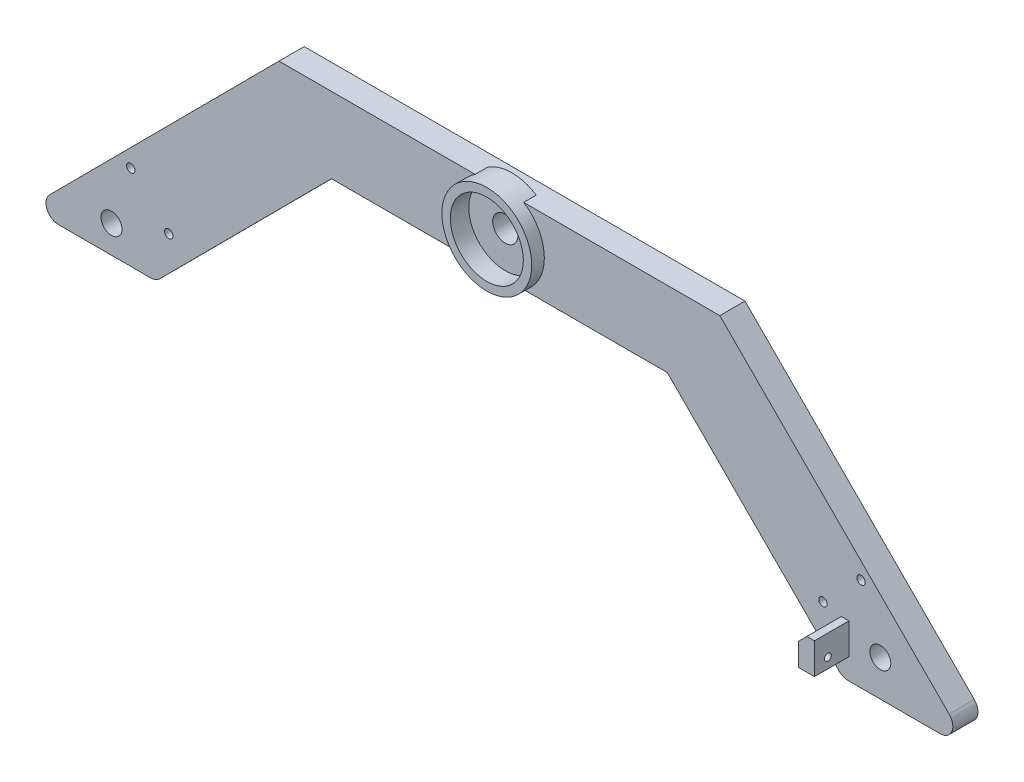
ISO-10303-21;
HEADER;
FILE_DESCRIPTION(('STEP AP214'),'2;1');
FILE_NAME('part.step','',(''),(''),'','','');
FILE_SCHEMA(('AUTOMOTIVE_DESIGN { 1 0 10303 214 1 1 1 1 }'));
ENDSEC;
DATA;
#1=APPLICATION_CONTEXT('core data for automotive mechanical design processes');
#2=APPLICATION_PROTOCOL_DEFINITION('international standard','automotive_design',2000,#1);
#3=PRODUCT_CONTEXT('',#1,'mechanical');
#4=PRODUCT('Part','Part','',(#3));
#5=PRODUCT_RELATED_PRODUCT_CATEGORY('part','',(#4));
#6=PRODUCT_DEFINITION_FORMATION('','',#4);
#7=PRODUCT_DEFINITION_CONTEXT('part definition',#1,'design');
#8=PRODUCT_DEFINITION('design','',#6,#7);
#9=PRODUCT_DEFINITION_SHAPE('','',#8);
#10=(LENGTH_UNIT() NAMED_UNIT(*) SI_UNIT(.MILLI.,.METRE.));
#11=(NAMED_UNIT(*) PLANE_ANGLE_UNIT() SI_UNIT($,.RADIAN.));
#12=(NAMED_UNIT(*) SI_UNIT($,.STERADIAN.) SOLID_ANGLE_UNIT());
#13=UNCERTAINTY_MEASURE_WITH_UNIT(LENGTH_MEASURE(1.E-05),#10,'distance_accuracy_value','');
#14=(GEOMETRIC_REPRESENTATION_CONTEXT(3) GLOBAL_UNCERTAINTY_ASSIGNED_CONTEXT((#13)) GLOBAL_UNIT_ASSIGNED_CONTEXT((#10,
#11,#12)) REPRESENTATION_CONTEXT('',''));
#15=CARTESIAN_POINT('',(0.,0.,0.));
#16=DIRECTION('',(0.,0.,1.));
#17=DIRECTION('',(1.,0.,0.));
#18=AXIS2_PLACEMENT_3D('',#15,#16,#17);
#19=CARTESIAN_POINT('',(-47.8356723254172,-72.890134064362,3.81));
#20=DIRECTION('',(0.,0.,-1.));
#21=DIRECTION('',(-1.,0.,0.));
#22=AXIS2_PLACEMENT_3D('',#19,#20,#21);
#23=PLANE('',#22);
#24=CARTESIAN_POINT('',(155.520779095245,-59.8647554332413,3.81));
#25=DIRECTION('',(0.,0.,-1.));
#26=DIRECTION('',(-1.,0.,0.));
#27=AXIS2_PLACEMENT_3D('',#24,#25,#26);
#28=CIRCLE('',#27,1.27);
#29=CARTESIAN_POINT('',(154.250779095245,-59.8647554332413,3.81));
#30=VERTEX_POINT('',#29);
#31=EDGE_CURVE('E560',#30,#30,#28,.T.);
#32=ORIENTED_EDGE('',*,*,#31,.T.);
#33=EDGE_LOOP('',(#32));
#34=FACE_BOUND('',#33,.T.);
#35=CARTESIAN_POINT('',(167.024128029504,-48.4154819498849,3.81));
#36=DIRECTION('',(0.,0.,-1.));
#37=DIRECTION('',(-1.,0.,0.));
#38=AXIS2_PLACEMENT_3D('',#35,#36,#37);
#39=CIRCLE('',#38,1.27);
#40=CARTESIAN_POINT('',(165.754128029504,-48.4154819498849,3.81));
#41=VERTEX_POINT('',#40);
#42=EDGE_CURVE('E555',#41,#41,#39,.T.);
#43=ORIENTED_EDGE('',*,*,#42,.T.);
#44=EDGE_LOOP('',(#43));
#45=FACE_BOUND('',#44,.T.);
#46=CARTESIAN_POINT('',(172.855760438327,-65.778134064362,3.81));
#47=DIRECTION('',(0.,0.,1.));
#48=DIRECTION('',(1.,0.,0.));
#49=AXIS2_PLACEMENT_3D('',#46,#47,#48);
#50=CIRCLE('',#49,3.175);
#51=CARTESIAN_POINT('',(176.030760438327,-65.778134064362,3.81));
#52=VERTEX_POINT('',#51);
#53=EDGE_CURVE('E276',#52,#52,#50,.T.);
#54=ORIENTED_EDGE('',*,*,#53,.F.);
#55=EDGE_LOOP('',(#54));
#56=FACE_BOUND('',#55,.T.);
#57=CARTESIAN_POINT('',(57.6277046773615,-11.930134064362,3.81));
#58=DIRECTION('',(0.,0.,-1.));
#59=DIRECTION('',(-1.,0.,0.));
#60=AXIS2_PLACEMENT_3D('',#57,#58,#59);
#61=CIRCLE('',#60,13.589);
#62=CARTESIAN_POINT('',(64.9627208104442,-23.3694723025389,3.81));
#63=VERTEX_POINT('',#62);
#64=CARTESIAN_POINT('',(64.9772639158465,-0.500134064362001,3.81));
#65=VERTEX_POINT('',#64);
#66=EDGE_CURVE('E416',#63,#65,#61,.F.);
#67=ORIENTED_EDGE('',*,*,#66,.F.);
#68=DIRECTION('',(1.,0.,0.));
#69=VECTOR('',#68,1.);
#70=CARTESIAN_POINT('',(6.82770467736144,-23.3694723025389,3.81));
#71=LINE('',#70,#69);
#72=CARTESIAN_POINT('',(108.427704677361,-23.3694723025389,3.81));
#73=VERTEX_POINT('',#72);
#74=EDGE_CURVE('E326',#63,#73,#71,.T.);
#75=ORIENTED_EDGE('',*,*,#74,.T.);
#76=DIRECTION('',(-0.7054389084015,0.708770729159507,0.));
#77=VECTOR('',#76,1.);
#78=CARTESIAN_POINT('',(160.390665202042,-75.5778563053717,3.81));
#79=LINE('',#78,#77);
#80=CARTESIAN_POINT('',(160.390665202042,-75.5778563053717,3.81));
#81=VERTEX_POINT('',#80);
#82=EDGE_CURVE('E322',#81,#73,#79,.T.);
#83=ORIENTED_EDGE('',*,*,#82,.F.);
#84=CARTESIAN_POINT('',(163.09108168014,-72.890134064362,3.81));
#85=DIRECTION('',(0.,0.,1.));
#86=DIRECTION('',(1.,0.,0.));
#87=AXIS2_PLACEMENT_3D('',#84,#85,#86);
#88=CIRCLE('',#87,3.81000000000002);
#89=CARTESIAN_POINT('',(163.09108168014,-76.700134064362,3.81));
#90=VERTEX_POINT('',#89);
#91=EDGE_CURVE('E319',#81,#90,#88,.T.);
#92=ORIENTED_EDGE('',*,*,#91,.T.);
#93=DIRECTION('',(-1.,0.,0.));
#94=VECTOR('',#93,1.);
#95=CARTESIAN_POINT('',(190.977704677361,-76.700134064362,3.81));
#96=LINE('',#95,#94);
#97=CARTESIAN_POINT('',(190.977704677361,-76.700134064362,3.81));
#98=VERTEX_POINT('',#97);
#99=EDGE_CURVE('E315',#98,#90,#96,.T.);
#100=ORIENTED_EDGE('',*,*,#99,.F.);
#101=CARTESIAN_POINT('',(190.977704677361,-72.890134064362,3.81));
#102=DIRECTION('',(0.,0.,1.));
#103=DIRECTION('',(1.,0.,0.));
#104=AXIS2_PLACEMENT_3D('',#101,#102,#103);
#105=CIRCLE('',#104,3.81000000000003);
#106=CARTESIAN_POINT('',(193.678121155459,-70.2024118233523,3.81));
#107=VERTEX_POINT('',#106);
#108=EDGE_CURVE('E312',#98,#107,#105,.T.);
#109=ORIENTED_EDGE('',*,*,#108,.T.);
#110=DIRECTION('',(-0.705438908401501,0.708770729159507,0.));
#111=VECTOR('',#110,1.);
#112=CARTESIAN_POINT('',(193.678121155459,-70.2024118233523,3.81));
#113=LINE('',#112,#111);
#114=CARTESIAN_POINT('',(124.303502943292,-0.500134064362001,3.81));
#115=VERTEX_POINT('',#114);
#116=EDGE_CURVE('E308',#107,#115,#113,.T.);
#117=ORIENTED_EDGE('',*,*,#116,.T.);
#118=DIRECTION('',(1.,0.,0.));
#119=VECTOR('',#118,1.);
#120=CARTESIAN_POINT('',(-9.04809358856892,-0.500134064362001,3.81));
#121=LINE('',#120,#119);
#122=EDGE_CURVE('E303',#65,#115,#121,.T.);
#123=ORIENTED_EDGE('',*,*,#122,.F.);
#124=EDGE_LOOP('',(#67,#75,#83,#92,#100,#109,#117,#123));
#125=FACE_BOUND('',#124,.T.);
#126=DIRECTION('',(0.,-1.,0.));
#127=VECTOR('',#126,1.);
#128=CARTESIAN_POINT('',(158.521238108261,-60.952134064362,3.81));
#129=LINE('',#128,#127);
#130=CARTESIAN_POINT('',(158.521238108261,-63.492134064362,3.81));
#131=VERTEX_POINT('',#130);
#132=CARTESIAN_POINT('',(158.521238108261,-70.350134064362,3.81));
#133=VERTEX_POINT('',#132);
#134=EDGE_CURVE('E217',#131,#133,#129,.T.);
#135=ORIENTED_EDGE('',*,*,#134,.F.);
#136=DIRECTION('',(-0.707106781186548,-0.707106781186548,0.));
#137=VECTOR('',#136,1.);
#138=CARTESIAN_POINT('',(50.643782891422,-171.369589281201,3.81));
#139=LINE('',#138,#137);
#140=CARTESIAN_POINT('',(161.061238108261,-60.952134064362,3.81));
#141=VERTEX_POINT('',#140);
#142=EDGE_CURVE('E71',#131,#141,#139,.F.);
#143=ORIENTED_EDGE('',*,*,#142,.T.);
#144=DIRECTION('',(-1.,0.,0.));
#145=VECTOR('',#144,1.);
#146=CARTESIAN_POINT('',(158.521238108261,-60.952134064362,3.81));
#147=LINE('',#146,#145);
#148=CARTESIAN_POINT('',(163.347238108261,-60.952134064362,3.81));
#149=VERTEX_POINT('',#148);
#150=EDGE_CURVE('E203',#149,#141,#147,.T.);
#151=ORIENTED_EDGE('',*,*,#150,.F.);
#152=DIRECTION('',(0.,1.,0.));
#153=VECTOR('',#152,1.);
#154=CARTESIAN_POINT('',(163.347238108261,-60.952134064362,3.81));
#155=LINE('',#154,#153);
#156=CARTESIAN_POINT('',(163.347238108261,-70.350134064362,3.81));
#157=VERTEX_POINT('',#156);
#158=EDGE_CURVE('E582',#157,#149,#155,.T.);
#159=ORIENTED_EDGE('',*,*,#158,.F.);
#160=DIRECTION('',(1.,0.,0.));
#161=VECTOR('',#160,1.);
#162=CARTESIAN_POINT('',(158.521238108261,-70.350134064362,3.81));
#163=LINE('',#162,#161);
#164=EDGE_CURVE('E579',#133,#157,#163,.T.);
#165=ORIENTED_EDGE('',*,*,#164,.F.);
#166=EDGE_LOOP('',(#135,#143,#151,#159,#165));
#167=FACE_BOUND('',#166,.T.);
#168=ADVANCED_FACE('F47',(#34,#45,#56,#125,#167),#23,.F.);
#169=CARTESIAN_POINT('',(57.6277046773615,-11.930134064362,-14.586307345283));
#170=DIRECTION('',(0.,0.,1.));
#171=DIRECTION('',(1.,0.,0.));
#172=AXIS2_PLACEMENT_3D('',#169,#170,#171);
#173=CYLINDRICAL_SURFACE('',#172,3.81);
#174=CARTESIAN_POINT('',(57.6277046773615,-11.930134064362,-3.81));
#175=DIRECTION('',(0.,0.,-1.));
#176=DIRECTION('',(-1.,0.,0.));
#177=AXIS2_PLACEMENT_3D('',#174,#175,#176);
#178=CIRCLE('',#177,3.81);
#179=CARTESIAN_POINT('',(53.8177046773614,-11.930134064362,-3.81));
#180=VERTEX_POINT('',#179);
#181=EDGE_CURVE('E235',#180,#180,#178,.F.);
#182=ORIENTED_EDGE('',*,*,#181,.F.);
#183=EDGE_LOOP('',(#182));
#184=FACE_BOUND('',#183,.T.);
#185=CARTESIAN_POINT('',(57.6277046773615,-11.930134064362,2.032));
#186=DIRECTION('',(0.,0.,1.));
#187=DIRECTION('',(1.,0.,0.));
#188=AXIS2_PLACEMENT_3D('',#185,#186,#187);
#189=CIRCLE('',#188,3.81);
#190=CARTESIAN_POINT('',(61.4377046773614,-11.930134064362,2.032));
#191=VERTEX_POINT('',#190);
#192=EDGE_CURVE('E233',#191,#191,#189,.F.);
#193=ORIENTED_EDGE('',*,*,#192,.F.);
#194=EDGE_LOOP('',(#193));
#195=FACE_BOUND('',#194,.T.);
#196=ADVANCED_FACE('F452',(#184,#195),#173,.F.);
#197=CARTESIAN_POINT('',(6.82770467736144,-23.3694723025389,3.81));
#198=DIRECTION('',(0.,1.,0.));
#199=DIRECTION('',(0.,0.,1.));
#200=AXIS2_PLACEMENT_3D('',#197,#198,#199);
#201=PLANE('',#200);
#202=DIRECTION('',(0.,0.,-1.));
#203=VECTOR('',#202,1.);
#204=CARTESIAN_POINT('',(64.9627208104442,-23.3694723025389,7.62));
#205=LINE('',#204,#203);
#206=CARTESIAN_POINT('',(64.9627208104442,-23.3694723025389,0.));
#207=VERTEX_POINT('',#206);
#208=EDGE_CURVE('E258',#207,#63,#205,.F.);
#209=ORIENTED_EDGE('',*,*,#208,.F.);
#210=DIRECTION('',(1.,0.,0.));
#211=VECTOR('',#210,1.);
#212=CARTESIAN_POINT('',(6.82770467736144,-23.3694723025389,0.));
#213=LINE('',#212,#211);
#214=CARTESIAN_POINT('',(50.2926885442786,-23.3694723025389,0.));
#215=VERTEX_POINT('',#214);
#216=EDGE_CURVE('E262',#215,#207,#213,.T.);
#217=ORIENTED_EDGE('',*,*,#216,.F.);
#218=DIRECTION('',(0.,0.,-1.));
#219=VECTOR('',#218,1.);
#220=CARTESIAN_POINT('',(50.2926885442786,-23.3694723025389,7.62));
#221=LINE('',#220,#219);
#222=CARTESIAN_POINT('',(50.2926885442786,-23.3694723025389,3.81));
#223=VERTEX_POINT('',#222);
#224=EDGE_CURVE('E251',#223,#215,#221,.T.);
#225=ORIENTED_EDGE('',*,*,#224,.F.);
#226=CARTESIAN_POINT('',(6.82770467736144,-23.3694723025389,3.81));
#227=VERTEX_POINT('',#226);
#228=EDGE_CURVE('E327',#227,#223,#71,.T.);
#229=ORIENTED_EDGE('',*,*,#228,.F.);
#230=DIRECTION('',(0.,0.,-1.));
#231=VECTOR('',#230,1.);
#232=CARTESIAN_POINT('',(6.82770467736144,-23.3694723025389,3.81));
#233=LINE('',#232,#231);
#234=CARTESIAN_POINT('',(6.82770467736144,-23.3694723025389,-3.81));
#235=VERTEX_POINT('',#234);
#236=EDGE_CURVE('E376',#227,#235,#233,.T.);
#237=ORIENTED_EDGE('',*,*,#236,.T.);
#238=DIRECTION('',(1.,0.,0.));
#239=VECTOR('',#238,1.);
#240=CARTESIAN_POINT('',(6.82770467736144,-23.3694723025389,-3.81));
#241=LINE('',#240,#239);
#242=CARTESIAN_POINT('',(108.427704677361,-23.3694723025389,-3.81));
#243=VERTEX_POINT('',#242);
#244=EDGE_CURVE('E288',#235,#243,#241,.T.);
#245=ORIENTED_EDGE('',*,*,#244,.T.);
#246=DIRECTION('',(0.,0.,-1.));
#247=VECTOR('',#246,1.);
#248=CARTESIAN_POINT('',(108.427704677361,-23.3694723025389,3.81));
#249=LINE('',#248,#247);
#250=EDGE_CURVE('E380',#73,#243,#249,.T.);
#251=ORIENTED_EDGE('',*,*,#250,.F.);
#252=ORIENTED_EDGE('',*,*,#74,.F.);
#253=EDGE_LOOP('',(#209,#217,#225,#229,#237,#245,#251,#252));
#254=FACE_BOUND('',#253,.T.);
#255=ADVANCED_FACE('F460',(#254),#201,.F.);
#256=CARTESIAN_POINT('',(-9.04809358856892,-0.500134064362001,3.81));
#257=DIRECTION('',(0.,1.,0.));
#258=DIRECTION('',(0.,0.,1.));
#259=AXIS2_PLACEMENT_3D('',#256,#257,#258);
#260=PLANE('',#259);
#261=DIRECTION('',(1.,0.,0.));
#262=VECTOR('',#261,1.);
#263=CARTESIAN_POINT('',(-9.04809358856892,-0.500134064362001,0.));
#264=LINE('',#263,#262);
#265=CARTESIAN_POINT('',(50.2781454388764,-0.500134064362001,0.));
#266=VERTEX_POINT('',#265);
#267=CARTESIAN_POINT('',(64.9772639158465,-0.500134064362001,0.));
#268=VERTEX_POINT('',#267);
#269=EDGE_CURVE('E417',#266,#268,#264,.T.);
#270=ORIENTED_EDGE('',*,*,#269,.T.);
#271=DIRECTION('',(0.,0.,-1.));
#272=VECTOR('',#271,1.);
#273=CARTESIAN_POINT('',(64.9772639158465,-0.500134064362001,7.62));
#274=LINE('',#273,#272);
#275=EDGE_CURVE('E255',#268,#65,#274,.F.);
#276=ORIENTED_EDGE('',*,*,#275,.T.);
#277=ORIENTED_EDGE('',*,*,#122,.T.);
#278=DIRECTION('',(0.,0.,-1.));
#279=VECTOR('',#278,1.);
#280=CARTESIAN_POINT('',(124.303502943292,-0.500134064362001,3.81));
#281=LINE('',#280,#279);
#282=CARTESIAN_POINT('',(124.303502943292,-0.500134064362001,-3.81));
#283=VERTEX_POINT('',#282);
#284=EDGE_CURVE('E396',#115,#283,#281,.T.);
#285=ORIENTED_EDGE('',*,*,#284,.T.);
#286=DIRECTION('',(1.,0.,0.));
#287=VECTOR('',#286,1.);
#288=CARTESIAN_POINT('',(-9.04809358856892,-0.500134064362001,-3.81));
#289=LINE('',#288,#287);
#290=CARTESIAN_POINT('',(-9.04809358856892,-0.500134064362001,-3.81));
#291=VERTEX_POINT('',#290);
#292=EDGE_CURVE('E350',#291,#283,#289,.T.);
#293=ORIENTED_EDGE('',*,*,#292,.F.);
#294=DIRECTION('',(0.,0.,-1.));
#295=VECTOR('',#294,1.);
#296=CARTESIAN_POINT('',(-9.04809358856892,-0.500134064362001,3.81));
#297=LINE('',#296,#295);
#298=CARTESIAN_POINT('',(-9.04809358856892,-0.500134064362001,3.81));
#299=VERTEX_POINT('',#298);
#300=EDGE_CURVE('E399',#299,#291,#297,.T.);
#301=ORIENTED_EDGE('',*,*,#300,.F.);
#302=CARTESIAN_POINT('',(50.2781454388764,-0.500134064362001,3.81));
#303=VERTEX_POINT('',#302);
#304=EDGE_CURVE('E304',#299,#303,#121,.T.);
#305=ORIENTED_EDGE('',*,*,#304,.T.);
#306=DIRECTION('',(0.,0.,-1.));
#307=VECTOR('',#306,1.);
#308=CARTESIAN_POINT('',(50.2781454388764,-0.500134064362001,7.62));
#309=LINE('',#308,#307);
#310=EDGE_CURVE('E244',#303,#266,#309,.T.);
#311=ORIENTED_EDGE('',*,*,#310,.T.);
#312=EDGE_LOOP('',(#270,#276,#277,#285,#293,#301,#305,#311));
#313=FACE_BOUND('',#312,.T.);
#314=ADVANCED_FACE('F602',(#313),#260,.T.);
#315=CARTESIAN_POINT('',(6.82770467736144,-23.3694723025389,3.81));
#316=DIRECTION('',(0.708770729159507,-0.7054389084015,0.));
#317=DIRECTION('',(0.7054389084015,0.708770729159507,0.));
#318=AXIS2_PLACEMENT_3D('',#315,#316,#317);
#319=PLANE('',#318);
#320=DIRECTION('',(-0.7054389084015,-0.708770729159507,0.));
#321=VECTOR('',#320,1.);
#322=CARTESIAN_POINT('',(6.82770467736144,-23.3694723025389,-3.81));
#323=LINE('',#322,#321);
#324=CARTESIAN_POINT('',(-45.1352558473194,-75.5778563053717,-3.81));
#325=VERTEX_POINT('',#324);
#326=EDGE_CURVE('E271',#235,#325,#323,.T.);
#327=ORIENTED_EDGE('',*,*,#326,.F.);
#328=ORIENTED_EDGE('',*,*,#236,.F.);
#329=DIRECTION('',(-0.7054389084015,-0.708770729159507,0.));
#330=VECTOR('',#329,1.);
#331=CARTESIAN_POINT('',(6.82770467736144,-23.3694723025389,3.81));
#332=LINE('',#331,#330);
#333=CARTESIAN_POINT('',(-45.1352558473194,-75.5778563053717,3.81));
#334=VERTEX_POINT('',#333);
#335=EDGE_CURVE('E283',#227,#334,#332,.T.);
#336=ORIENTED_EDGE('',*,*,#335,.T.);
#337=DIRECTION('',(0.,0.,-1.));
#338=VECTOR('',#337,1.);
#339=CARTESIAN_POINT('',(-45.1352558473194,-75.5778563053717,3.81));
#340=LINE('',#339,#338);
#341=EDGE_CURVE('E330',#334,#325,#340,.T.);
#342=ORIENTED_EDGE('',*,*,#341,.T.);
#343=EDGE_LOOP('',(#327,#328,#336,#342));
#344=FACE_BOUND('',#343,.T.);
#345=ADVANCED_FACE('F599',(#344),#319,.T.);
#346=CARTESIAN_POINT('',(160.390665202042,-75.5778563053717,3.81));
#347=DIRECTION('',(-0.708770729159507,-0.7054389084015,0.));
#348=DIRECTION('',(0.7054389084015,-0.708770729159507,0.));
#349=AXIS2_PLACEMENT_3D('',#346,#347,#348);
#350=PLANE('',#349);
#351=DIRECTION('',(-0.7054389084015,0.708770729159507,0.));
#352=VECTOR('',#351,1.);
#353=CARTESIAN_POINT('',(160.390665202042,-75.5778563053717,-3.81));
#354=LINE('',#353,#352);
#355=CARTESIAN_POINT('',(160.390665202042,-75.5778563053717,-3.81));
#356=VERTEX_POINT('',#355);
#357=EDGE_CURVE('E369',#356,#243,#354,.T.);
#358=ORIENTED_EDGE('',*,*,#357,.F.);
#359=DIRECTION('',(0.,0.,-1.));
#360=VECTOR('',#359,1.);
#361=CARTESIAN_POINT('',(160.390665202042,-75.5778563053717,3.81));
#362=LINE('',#361,#360);
#363=EDGE_CURVE('E383',#81,#356,#362,.T.);
#364=ORIENTED_EDGE('',*,*,#363,.F.);
#365=ORIENTED_EDGE('',*,*,#82,.T.);
#366=ORIENTED_EDGE('',*,*,#250,.T.);
#367=EDGE_LOOP('',(#358,#364,#365,#366));
#368=FACE_BOUND('',#367,.T.);
#369=ADVANCED_FACE('F601',(#368),#350,.T.);
#370=CARTESIAN_POINT('',(163.09108168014,-72.890134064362,3.81));
#371=DIRECTION('',(0.,0.,-1.));
#372=DIRECTION('',(-1.,0.,0.));
#373=AXIS2_PLACEMENT_3D('',#370,#371,#372);
#374=CYLINDRICAL_SURFACE('',#373,3.81000000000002);
#375=CARTESIAN_POINT('',(163.09108168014,-72.890134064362,-3.81));
#376=DIRECTION('',(0.,0.,1.));
#377=DIRECTION('',(1.,0.,0.));
#378=AXIS2_PLACEMENT_3D('',#375,#376,#377);
#379=CIRCLE('',#378,3.81000000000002);
#380=CARTESIAN_POINT('',(163.09108168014,-76.700134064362,-3.81));
#381=VERTEX_POINT('',#380);
#382=EDGE_CURVE('E365',#356,#381,#379,.T.);
#383=ORIENTED_EDGE('',*,*,#382,.T.);
#384=DIRECTION('',(0.,0.,-1.));
#385=VECTOR('',#384,1.);
#386=CARTESIAN_POINT('',(163.09108168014,-76.700134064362,3.81));
#387=LINE('',#386,#385);
#388=EDGE_CURVE('E386',#90,#381,#387,.T.);
#389=ORIENTED_EDGE('',*,*,#388,.F.);
#390=ORIENTED_EDGE('',*,*,#91,.F.);
#391=ORIENTED_EDGE('',*,*,#363,.T.);
#392=EDGE_LOOP('',(#383,#389,#390,#391));
#393=FACE_BOUND('',#392,.T.);
#394=ADVANCED_FACE('F630',(#393),#374,.T.);
#395=CARTESIAN_POINT('',(190.977704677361,-76.700134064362,3.81));
#396=DIRECTION('',(0.,-1.,0.));
#397=DIRECTION('',(1.,0.,0.));
#398=AXIS2_PLACEMENT_3D('',#395,#396,#397);
#399=PLANE('',#398);
#400=DIRECTION('',(-1.,0.,0.));
#401=VECTOR('',#400,1.);
#402=CARTESIAN_POINT('',(190.977704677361,-76.700134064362,-3.81));
#403=LINE('',#402,#401);
#404=CARTESIAN_POINT('',(190.977704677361,-76.700134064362,-3.81));
#405=VERTEX_POINT('',#404);
#406=EDGE_CURVE('E361',#405,#381,#403,.T.);
#407=ORIENTED_EDGE('',*,*,#406,.F.);
#408=DIRECTION('',(0.,0.,-1.));
#409=VECTOR('',#408,1.);
#410=CARTESIAN_POINT('',(190.977704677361,-76.700134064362,3.81));
#411=LINE('',#410,#409);
#412=EDGE_CURVE('E389',#98,#405,#411,.T.);
#413=ORIENTED_EDGE('',*,*,#412,.F.);
#414=ORIENTED_EDGE('',*,*,#99,.T.);
#415=ORIENTED_EDGE('',*,*,#388,.T.);
#416=EDGE_LOOP('',(#407,#413,#414,#415));
#417=FACE_BOUND('',#416,.T.);
#418=ADVANCED_FACE('F626',(#417),#399,.T.);
#419=CARTESIAN_POINT('',(190.977704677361,-72.890134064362,3.81));
#420=DIRECTION('',(0.,0.,-1.));
#421=DIRECTION('',(-1.,0.,0.));
#422=AXIS2_PLACEMENT_3D('',#419,#420,#421);
#423=CYLINDRICAL_SURFACE('',#422,3.81000000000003);
#424=CARTESIAN_POINT('',(190.977704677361,-72.890134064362,-3.81));
#425=DIRECTION('',(0.,0.,1.));
#426=DIRECTION('',(1.,0.,0.));
#427=AXIS2_PLACEMENT_3D('',#424,#425,#426);
#428=CIRCLE('',#427,3.81000000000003);
#429=CARTESIAN_POINT('',(193.678121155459,-70.2024118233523,-3.81));
#430=VERTEX_POINT('',#429);
#431=EDGE_CURVE('E358',#405,#430,#428,.T.);
#432=ORIENTED_EDGE('',*,*,#431,.T.);
#433=DIRECTION('',(0.,0.,-1.));
#434=VECTOR('',#433,1.);
#435=CARTESIAN_POINT('',(193.678121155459,-70.2024118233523,3.81));
#436=LINE('',#435,#434);
#437=EDGE_CURVE('E392',#107,#430,#436,.T.);
#438=ORIENTED_EDGE('',*,*,#437,.F.);
#439=ORIENTED_EDGE('',*,*,#108,.F.);
#440=ORIENTED_EDGE('',*,*,#412,.T.);
#441=EDGE_LOOP('',(#432,#438,#439,#440));
#442=FACE_BOUND('',#441,.T.);
#443=ADVANCED_FACE('F622',(#442),#423,.T.);
#444=CARTESIAN_POINT('',(193.678121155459,-70.2024118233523,3.81));
#445=DIRECTION('',(-0.708770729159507,-0.7054389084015,0.));
#446=DIRECTION('',(0.7054389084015,-0.708770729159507,0.));
#447=AXIS2_PLACEMENT_3D('',#444,#445,#446);
#448=PLANE('',#447);
#449=DIRECTION('',(-0.705438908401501,0.708770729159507,0.));
#450=VECTOR('',#449,1.);
#451=CARTESIAN_POINT('',(193.678121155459,-70.2024118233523,-3.81));
#452=LINE('',#451,#450);
#453=EDGE_CURVE('E354',#430,#283,#452,.T.);
#454=ORIENTED_EDGE('',*,*,#453,.T.);
#455=ORIENTED_EDGE('',*,*,#284,.F.);
#456=ORIENTED_EDGE('',*,*,#116,.F.);
#457=ORIENTED_EDGE('',*,*,#437,.T.);
#458=EDGE_LOOP('',(#454,#455,#456,#457));
#459=FACE_BOUND('',#458,.T.);
#460=ADVANCED_FACE('F615',(#459),#448,.F.);
#461=CARTESIAN_POINT('',(-78.4227118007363,-70.2024118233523,3.81));
#462=DIRECTION('',(-0.708770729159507,0.7054389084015,0.));
#463=DIRECTION('',(-0.7054389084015,-0.708770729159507,0.));
#464=AXIS2_PLACEMENT_3D('',#461,#462,#463);
#465=PLANE('',#464);
#466=DIRECTION('',(0.7054389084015,0.708770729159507,0.));
#467=VECTOR('',#466,1.);
#468=CARTESIAN_POINT('',(-78.4227118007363,-70.2024118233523,-3.81));
#469=LINE('',#468,#467);
#470=CARTESIAN_POINT('',(-78.4227118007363,-70.2024118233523,-3.81));
#471=VERTEX_POINT('',#470);
#472=EDGE_CURVE('E346',#471,#291,#469,.T.);
#473=ORIENTED_EDGE('',*,*,#472,.F.);
#474=DIRECTION('',(0.,0.,-1.));
#475=VECTOR('',#474,1.);
#476=CARTESIAN_POINT('',(-78.4227118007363,-70.2024118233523,3.81));
#477=LINE('',#476,#475);
#478=CARTESIAN_POINT('',(-78.4227118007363,-70.2024118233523,3.81));
#479=VERTEX_POINT('',#478);
#480=EDGE_CURVE('E402',#479,#471,#477,.T.);
#481=ORIENTED_EDGE('',*,*,#480,.F.);
#482=DIRECTION('',(0.7054389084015,0.708770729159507,0.));
#483=VECTOR('',#482,1.);
#484=CARTESIAN_POINT('',(-78.4227118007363,-70.2024118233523,3.81));
#485=LINE('',#484,#483);
#486=EDGE_CURVE('E299',#479,#299,#485,.T.);
#487=ORIENTED_EDGE('',*,*,#486,.T.);
#488=ORIENTED_EDGE('',*,*,#300,.T.);
#489=EDGE_LOOP('',(#473,#481,#487,#488));
#490=FACE_BOUND('',#489,.T.);
#491=ADVANCED_FACE('F611',(#490),#465,.T.);
#492=CARTESIAN_POINT('',(-75.7222953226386,-72.890134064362,3.81));
#493=DIRECTION('',(0.,0.,-1.));
#494=DIRECTION('',(-1.,0.,0.));
#495=AXIS2_PLACEMENT_3D('',#492,#493,#494);
#496=CYLINDRICAL_SURFACE('',#495,3.80999999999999);
#497=CARTESIAN_POINT('',(-75.7222953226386,-72.890134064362,-3.81));
#498=DIRECTION('',(0.,0.,-1.));
#499=DIRECTION('',(-1.,0.,0.));
#500=AXIS2_PLACEMENT_3D('',#497,#498,#499);
#501=CIRCLE('',#500,3.80999999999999);
#502=CARTESIAN_POINT('',(-75.7222953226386,-76.700134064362,-3.81));
#503=VERTEX_POINT('',#502);
#504=EDGE_CURVE('E342',#503,#471,#501,.T.);
#505=ORIENTED_EDGE('',*,*,#504,.F.);
#506=DIRECTION('',(0.,0.,-1.));
#507=VECTOR('',#506,1.);
#508=CARTESIAN_POINT('',(-75.7222953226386,-76.700134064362,3.81));
#509=LINE('',#508,#507);
#510=CARTESIAN_POINT('',(-75.7222953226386,-76.700134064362,3.81));
#511=VERTEX_POINT('',#510);
#512=EDGE_CURVE('E405',#511,#503,#509,.T.);
#513=ORIENTED_EDGE('',*,*,#512,.F.);
#514=CARTESIAN_POINT('',(-75.7222953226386,-72.890134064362,3.81));
#515=DIRECTION('',(0.,0.,-1.));
#516=DIRECTION('',(-1.,0.,0.));
#517=AXIS2_PLACEMENT_3D('',#514,#515,#516);
#518=CIRCLE('',#517,3.80999999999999);
#519=EDGE_CURVE('E295',#511,#479,#518,.T.);
#520=ORIENTED_EDGE('',*,*,#519,.T.);
#521=ORIENTED_EDGE('',*,*,#480,.T.);
#522=EDGE_LOOP('',(#505,#513,#520,#521));
#523=FACE_BOUND('',#522,.T.);
#524=ADVANCED_FACE('F607',(#523),#496,.T.);
#525=CARTESIAN_POINT('',(-75.7222953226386,-76.700134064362,3.81));
#526=DIRECTION('',(0.,1.,0.));
#527=DIRECTION('',(-1.,0.,0.));
#528=AXIS2_PLACEMENT_3D('',#525,#526,#527);
#529=PLANE('',#528);
#530=DIRECTION('',(1.,0.,0.));
#531=VECTOR('',#530,1.);
#532=CARTESIAN_POINT('',(-75.7222953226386,-76.700134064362,-3.81));
#533=LINE('',#532,#531);
#534=CARTESIAN_POINT('',(-47.8356723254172,-76.700134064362,-3.81));
#535=VERTEX_POINT('',#534);
#536=EDGE_CURVE('E338',#503,#535,#533,.T.);
#537=ORIENTED_EDGE('',*,*,#536,.T.);
#538=DIRECTION('',(0.,0.,-1.));
#539=VECTOR('',#538,1.);
#540=CARTESIAN_POINT('',(-47.8356723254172,-76.700134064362,3.81));
#541=LINE('',#540,#539);
#542=CARTESIAN_POINT('',(-47.8356723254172,-76.700134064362,3.81));
#543=VERTEX_POINT('',#542);
#544=EDGE_CURVE('E408',#543,#535,#541,.T.);
#545=ORIENTED_EDGE('',*,*,#544,.F.);
#546=DIRECTION('',(1.,0.,0.));
#547=VECTOR('',#546,1.);
#548=CARTESIAN_POINT('',(-75.7222953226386,-76.700134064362,3.81));
#549=LINE('',#548,#547);
#550=EDGE_CURVE('E292',#511,#543,#549,.T.);
#551=ORIENTED_EDGE('',*,*,#550,.F.);
#552=ORIENTED_EDGE('',*,*,#512,.T.);
#553=EDGE_LOOP('',(#537,#545,#551,#552));
#554=FACE_BOUND('',#553,.T.);
#555=ADVANCED_FACE('F476',(#554),#529,.F.);
#556=CARTESIAN_POINT('',(-47.8356723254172,-72.890134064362,3.81));
#557=DIRECTION('',(0.,0.,-1.));
#558=DIRECTION('',(-1.,0.,0.));
#559=AXIS2_PLACEMENT_3D('',#556,#557,#558);
#560=CYLINDRICAL_SURFACE('',#559,3.81000000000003);
#561=CARTESIAN_POINT('',(-47.8356723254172,-72.890134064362,-3.81));
#562=DIRECTION('',(0.,0.,-1.));
#563=DIRECTION('',(-1.,0.,0.));
#564=AXIS2_PLACEMENT_3D('',#561,#562,#563);
#565=CIRCLE('',#564,3.81000000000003);
#566=EDGE_CURVE('E334',#325,#535,#565,.T.);
#567=ORIENTED_EDGE('',*,*,#566,.F.);
#568=ORIENTED_EDGE('',*,*,#341,.F.);
#569=CARTESIAN_POINT('',(-47.8356723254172,-72.890134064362,3.81));
#570=DIRECTION('',(0.,0.,-1.));
#571=DIRECTION('',(-1.,0.,0.));
#572=AXIS2_PLACEMENT_3D('',#569,#570,#571);
#573=CIRCLE('',#572,3.81000000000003);
#574=EDGE_CURVE('E287',#334,#543,#573,.T.);
#575=ORIENTED_EDGE('',*,*,#574,.T.);
#576=ORIENTED_EDGE('',*,*,#544,.T.);
#577=EDGE_LOOP('',(#567,#568,#575,#576));
#578=FACE_BOUND('',#577,.T.);
#579=ADVANCED_FACE('F468',(#578),#560,.T.);
#580=CARTESIAN_POINT('',(-53.8886629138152,-50.9554819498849,3.81));
#581=DIRECTION('',(0.,0.,-1.));
#582=DIRECTION('',(-1.,0.,0.));
#583=AXIS2_PLACEMENT_3D('',#580,#581,#582);
#584=CIRCLE('',#583,1.27);
#585=CARTESIAN_POINT('',(-55.1586629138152,-50.9554819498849,3.81));
#586=VERTEX_POINT('',#585);
#587=EDGE_CURVE('E482',#586,#586,#584,.T.);
#588=ORIENTED_EDGE('',*,*,#587,.T.);
#589=EDGE_LOOP('',(#588));
#590=FACE_BOUND('',#589,.T.);
#591=CARTESIAN_POINT('',(-42.3853139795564,-62.4047554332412,3.81));
#592=DIRECTION('',(0.,0.,-1.));
#593=DIRECTION('',(-1.,0.,0.));
#594=AXIS2_PLACEMENT_3D('',#591,#592,#593);
#595=CIRCLE('',#594,1.27);
#596=CARTESIAN_POINT('',(-43.6553139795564,-62.4047554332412,3.81));
#597=VERTEX_POINT('',#596);
#598=EDGE_CURVE('E486',#597,#597,#595,.T.);
#599=ORIENTED_EDGE('',*,*,#598,.T.);
#600=EDGE_LOOP('',(#599));
#601=FACE_BOUND('',#600,.T.);
#602=EDGE_CURVE('E379',#303,#223,#61,.F.);
#603=ORIENTED_EDGE('',*,*,#602,.F.);
#604=ORIENTED_EDGE('',*,*,#304,.F.);
#605=ORIENTED_EDGE('',*,*,#486,.F.);
#606=ORIENTED_EDGE('',*,*,#519,.F.);
#607=ORIENTED_EDGE('',*,*,#550,.T.);
#608=ORIENTED_EDGE('',*,*,#574,.F.);
#609=ORIENTED_EDGE('',*,*,#335,.F.);
#610=ORIENTED_EDGE('',*,*,#228,.T.);
#611=EDGE_LOOP('',(#603,#604,#605,#606,#607,#608,#609,#610));
#612=FACE_BOUND('',#611,.T.);
#613=CARTESIAN_POINT('',(-59.7202953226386,-68.318134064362,3.81));
#614=DIRECTION('',(0.,0.,1.));
#615=DIRECTION('',(1.,0.,0.));
#616=AXIS2_PLACEMENT_3D('',#613,#614,#615);
#617=CIRCLE('',#616,3.175);
#618=CARTESIAN_POINT('',(-56.5452953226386,-68.318134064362,3.81));
#619=VERTEX_POINT('',#618);
#620=EDGE_CURVE('E272',#619,#619,#617,.T.);
#621=ORIENTED_EDGE('',*,*,#620,.F.);
#622=EDGE_LOOP('',(#621));
#623=FACE_BOUND('',#622,.T.);
#624=ADVANCED_FACE('F455',(#590,#601,#612,#623),#23,.F.);
#625=CARTESIAN_POINT('',(-47.8356723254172,-72.890134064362,-3.81));
#626=DIRECTION('',(0.,0.,-1.));
#627=DIRECTION('',(-1.,0.,0.));
#628=AXIS2_PLACEMENT_3D('',#625,#626,#627);
#629=PLANE('',#628);
#630=CARTESIAN_POINT('',(155.520779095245,-59.8647554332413,-3.81));
#631=DIRECTION('',(0.,0.,-1.));
#632=DIRECTION('',(-1.,0.,0.));
#633=AXIS2_PLACEMENT_3D('',#630,#631,#632);
#634=CIRCLE('',#633,1.27);
#635=CARTESIAN_POINT('',(154.250779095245,-59.8647554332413,-3.81));
#636=VERTEX_POINT('',#635);
#637=EDGE_CURVE('E895',#636,#636,#634,.T.);
#638=ORIENTED_EDGE('',*,*,#637,.F.);
#639=EDGE_LOOP('',(#638));
#640=FACE_BOUND('',#639,.T.);
#641=CARTESIAN_POINT('',(167.024128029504,-48.4154819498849,-3.81));
#642=DIRECTION('',(0.,0.,-1.));
#643=DIRECTION('',(-1.,0.,0.));
#644=AXIS2_PLACEMENT_3D('',#641,#642,#643);
#645=CIRCLE('',#644,1.27);
#646=CARTESIAN_POINT('',(165.754128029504,-48.4154819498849,-3.81));
#647=VERTEX_POINT('',#646);
#648=EDGE_CURVE('E899',#647,#647,#645,.T.);
#649=ORIENTED_EDGE('',*,*,#648,.F.);
#650=EDGE_LOOP('',(#649));
#651=FACE_BOUND('',#650,.T.);
#652=CARTESIAN_POINT('',(-53.8886629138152,-50.9554819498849,-3.81));
#653=DIRECTION('',(0.,0.,-1.));
#654=DIRECTION('',(-1.,0.,0.));
#655=AXIS2_PLACEMENT_3D('',#652,#653,#654);
#656=CIRCLE('',#655,1.27);
#657=CARTESIAN_POINT('',(-55.1586629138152,-50.9554819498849,-3.81));
#658=VERTEX_POINT('',#657);
#659=EDGE_CURVE('E553',#658,#658,#656,.T.);
#660=ORIENTED_EDGE('',*,*,#659,.F.);
#661=EDGE_LOOP('',(#660));
#662=FACE_BOUND('',#661,.T.);
#663=CARTESIAN_POINT('',(-42.3853139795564,-62.4047554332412,-3.81));
#664=DIRECTION('',(0.,0.,-1.));
#665=DIRECTION('',(-1.,0.,0.));
#666=AXIS2_PLACEMENT_3D('',#663,#664,#665);
#667=CIRCLE('',#666,1.27);
#668=CARTESIAN_POINT('',(-43.6553139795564,-62.4047554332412,-3.81));
#669=VERTEX_POINT('',#668);
#670=EDGE_CURVE('E562',#669,#669,#667,.T.);
#671=ORIENTED_EDGE('',*,*,#670,.F.);
#672=EDGE_LOOP('',(#671));
#673=FACE_BOUND('',#672,.T.);
#674=ORIENTED_EDGE('',*,*,#181,.T.);
#675=EDGE_LOOP('',(#674));
#676=FACE_BOUND('',#675,.T.);
#677=CARTESIAN_POINT('',(-59.7202953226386,-68.318134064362,-3.81));
#678=DIRECTION('',(0.,0.,1.));
#679=DIRECTION('',(1.,0.,0.));
#680=AXIS2_PLACEMENT_3D('',#677,#678,#679);
#681=CIRCLE('',#680,3.175);
#682=CARTESIAN_POINT('',(-56.5452953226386,-68.318134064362,-3.81));
#683=VERTEX_POINT('',#682);
#684=EDGE_CURVE('E267',#683,#683,#681,.T.);
#685=ORIENTED_EDGE('',*,*,#684,.T.);
#686=EDGE_LOOP('',(#685));
#687=FACE_BOUND('',#686,.T.);
#688=CARTESIAN_POINT('',(172.855760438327,-65.778134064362,-3.81));
#689=DIRECTION('',(0.,0.,1.));
#690=DIRECTION('',(1.,0.,0.));
#691=AXIS2_PLACEMENT_3D('',#688,#689,#690);
#692=CIRCLE('',#691,3.175);
#693=CARTESIAN_POINT('',(176.030760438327,-65.778134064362,-3.81));
#694=VERTEX_POINT('',#693);
#695=EDGE_CURVE('E266',#694,#694,#692,.T.);
#696=ORIENTED_EDGE('',*,*,#695,.T.);
#697=EDGE_LOOP('',(#696));
#698=FACE_BOUND('',#697,.T.);
#699=ORIENTED_EDGE('',*,*,#326,.T.);
#700=ORIENTED_EDGE('',*,*,#566,.T.);
#701=ORIENTED_EDGE('',*,*,#536,.F.);
#702=ORIENTED_EDGE('',*,*,#504,.T.);
#703=ORIENTED_EDGE('',*,*,#472,.T.);
#704=ORIENTED_EDGE('',*,*,#292,.T.);
#705=ORIENTED_EDGE('',*,*,#453,.F.);
#706=ORIENTED_EDGE('',*,*,#431,.F.);
#707=ORIENTED_EDGE('',*,*,#406,.T.);
#708=ORIENTED_EDGE('',*,*,#382,.F.);
#709=ORIENTED_EDGE('',*,*,#357,.T.);
#710=ORIENTED_EDGE('',*,*,#244,.F.);
#711=EDGE_LOOP('',(#699,#700,#701,#702,#703,#704,#705,#706,#707,#708,#709,#710));
#712=FACE_BOUND('',#711,.T.);
#713=ADVANCED_FACE('F467',(#640,#651,#662,#673,#676,#687,#698,#712),#629,.T.);
#714=CARTESIAN_POINT('',(172.855760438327,-65.778134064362,-3.81));
#715=DIRECTION('',(0.,0.,1.));
#716=DIRECTION('',(1.,0.,0.));
#717=AXIS2_PLACEMENT_3D('',#714,#715,#716);
#718=CYLINDRICAL_SURFACE('',#717,3.175);
#719=ORIENTED_EDGE('',*,*,#695,.F.);
#720=EDGE_LOOP('',(#719));
#721=FACE_BOUND('',#720,.T.);
#722=ORIENTED_EDGE('',*,*,#53,.T.);
#723=EDGE_LOOP('',(#722));
#724=FACE_BOUND('',#723,.T.);
#725=ADVANCED_FACE('F473',(#721,#724),#718,.F.);
#726=CARTESIAN_POINT('',(-59.7202953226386,-68.318134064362,-3.81));
#727=DIRECTION('',(0.,0.,1.));
#728=DIRECTION('',(1.,0.,0.));
#729=AXIS2_PLACEMENT_3D('',#726,#727,#728);
#730=CYLINDRICAL_SURFACE('',#729,3.175);
#731=ORIENTED_EDGE('',*,*,#684,.F.);
#732=EDGE_LOOP('',(#731));
#733=FACE_BOUND('',#732,.T.);
#734=ORIENTED_EDGE('',*,*,#620,.T.);
#735=EDGE_LOOP('',(#734));
#736=FACE_BOUND('',#735,.T.);
#737=ADVANCED_FACE('F491',(#733,#736),#730,.F.);
#738=CARTESIAN_POINT('',(57.6277046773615,-11.930134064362,0.));
#739=DIRECTION('',(0.,0.,1.));
#740=DIRECTION('',(1.,0.,0.));
#741=AXIS2_PLACEMENT_3D('',#738,#739,#740);
#742=PLANE('',#741);
#743=CARTESIAN_POINT('',(57.6277046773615,-11.930134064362,0.));
#744=DIRECTION('',(0.,0.,1.));
#745=DIRECTION('',(1.,0.,0.));
#746=AXIS2_PLACEMENT_3D('',#743,#744,#745);
#747=CIRCLE('',#746,13.589);
#748=EDGE_CURVE('E239',#215,#207,#747,.T.);
#749=ORIENTED_EDGE('',*,*,#748,.F.);
#750=ORIENTED_EDGE('',*,*,#216,.T.);
#751=EDGE_LOOP('',(#749,#750));
#752=FACE_BOUND('',#751,.T.);
#753=ADVANCED_FACE('F493',(#752),#742,.F.);
#754=CARTESIAN_POINT('',(57.6277046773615,-11.930134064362,7.62));
#755=DIRECTION('',(0.,0.,-1.));
#756=DIRECTION('',(-1.,0.,0.));
#757=AXIS2_PLACEMENT_3D('',#754,#755,#756);
#758=CYLINDRICAL_SURFACE('',#757,13.589);
#759=CARTESIAN_POINT('',(57.6277046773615,-11.930134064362,7.62));
#760=DIRECTION('',(0.,0.,1.));
#761=DIRECTION('',(1.,0.,0.));
#762=AXIS2_PLACEMENT_3D('',#759,#760,#761);
#763=CIRCLE('',#762,13.589);
#764=CARTESIAN_POINT('',(71.2167046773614,-11.930134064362,7.62));
#765=VERTEX_POINT('',#764);
#766=EDGE_CURVE('E240',#765,#765,#763,.T.);
#767=ORIENTED_EDGE('',*,*,#766,.F.);
#768=EDGE_LOOP('',(#767));
#769=FACE_BOUND('',#768,.T.);
#770=ORIENTED_EDGE('',*,*,#748,.T.);
#771=ORIENTED_EDGE('',*,*,#208,.T.);
#772=ORIENTED_EDGE('',*,*,#66,.T.);
#773=ORIENTED_EDGE('',*,*,#275,.F.);
#774=EDGE_CURVE('E245',#268,#266,#747,.T.);
#775=ORIENTED_EDGE('',*,*,#774,.T.);
#776=ORIENTED_EDGE('',*,*,#310,.F.);
#777=ORIENTED_EDGE('',*,*,#602,.T.);
#778=ORIENTED_EDGE('',*,*,#224,.T.);
#779=EDGE_LOOP('',(#770,#771,#772,#773,#775,#776,#777,#778));
#780=FACE_BOUND('',#779,.T.);
#781=ADVANCED_FACE('F501',(#769,#780),#758,.T.);
#782=CARTESIAN_POINT('',(57.6277046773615,-11.930134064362,7.62));
#783=DIRECTION('',(0.,0.,1.));
#784=DIRECTION('',(1.,0.,0.));
#785=AXIS2_PLACEMENT_3D('',#782,#783,#784);
#786=PLANE('',#785);
#787=CARTESIAN_POINT('',(57.6277046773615,-11.930134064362,7.62));
#788=DIRECTION('',(0.,0.,1.));
#789=DIRECTION('',(1.,0.,0.));
#790=AXIS2_PLACEMENT_3D('',#787,#788,#789);
#791=CIRCLE('',#790,11.049);
#792=CARTESIAN_POINT('',(68.6767046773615,-11.930134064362,7.62));
#793=VERTEX_POINT('',#792);
#794=EDGE_CURVE('E220',#793,#793,#791,.T.);
#795=ORIENTED_EDGE('',*,*,#794,.F.);
#796=EDGE_LOOP('',(#795));
#797=FACE_BOUND('',#796,.T.);
#798=ORIENTED_EDGE('',*,*,#766,.T.);
#799=EDGE_LOOP('',(#798));
#800=FACE_BOUND('',#799,.T.);
#801=ADVANCED_FACE('F509',(#797,#800),#786,.T.);
#802=ORIENTED_EDGE('',*,*,#269,.F.);
#803=ORIENTED_EDGE('',*,*,#774,.F.);
#804=EDGE_LOOP('',(#802,#803));
#805=FACE_BOUND('',#804,.T.);
#806=ADVANCED_FACE('F504',(#805),#742,.F.);
#807=CARTESIAN_POINT('',(57.6277046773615,-11.930134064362,2.032));
#808=DIRECTION('',(0.,0.,1.));
#809=DIRECTION('',(1.,0.,0.));
#810=AXIS2_PLACEMENT_3D('',#807,#808,#809);
#811=PLANE('',#810);
#812=CARTESIAN_POINT('',(57.6277046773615,-11.930134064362,2.032));
#813=DIRECTION('',(0.,0.,1.));
#814=DIRECTION('',(1.,0.,0.));
#815=AXIS2_PLACEMENT_3D('',#812,#813,#814);
#816=CIRCLE('',#815,11.049);
#817=CARTESIAN_POINT('',(68.6767046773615,-11.930134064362,2.032));
#818=VERTEX_POINT('',#817);
#819=EDGE_CURVE('E225',#818,#818,#816,.T.);
#820=ORIENTED_EDGE('',*,*,#819,.T.);
#821=EDGE_LOOP('',(#820));
#822=FACE_BOUND('',#821,.T.);
#823=ORIENTED_EDGE('',*,*,#192,.T.);
#824=EDGE_LOOP('',(#823));
#825=FACE_BOUND('',#824,.T.);
#826=ADVANCED_FACE('F513',(#822,#825),#811,.T.);
#827=CARTESIAN_POINT('',(57.6277046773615,-11.930134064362,2.032));
#828=DIRECTION('',(0.,0.,1.));
#829=DIRECTION('',(1.,0.,0.));
#830=AXIS2_PLACEMENT_3D('',#827,#828,#829);
#831=CYLINDRICAL_SURFACE('',#830,11.049);
#832=ORIENTED_EDGE('',*,*,#819,.F.);
#833=EDGE_LOOP('',(#832));
#834=FACE_BOUND('',#833,.T.);
#835=ORIENTED_EDGE('',*,*,#794,.T.);
#836=EDGE_LOOP('',(#835));
#837=FACE_BOUND('',#836,.T.);
#838=ADVANCED_FACE('F518',(#834,#837),#831,.F.);
#839=CARTESIAN_POINT('',(158.521238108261,-60.952134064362,14.224));
#840=DIRECTION('',(1.,0.,0.));
#841=DIRECTION('',(0.,0.,-1.));
#842=AXIS2_PLACEMENT_3D('',#839,#840,#841);
#843=PLANE('',#842);
#844=CARTESIAN_POINT('',(158.521238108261,-67.2599161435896,10.1651141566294));
#845=DIRECTION('',(1.,0.,0.));
#846=DIRECTION('',(0.,0.,-1.));
#847=AXIS2_PLACEMENT_3D('',#844,#845,#846);
#848=CIRCLE('',#847,1.5367);
#849=CARTESIAN_POINT('',(158.521238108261,-67.2599161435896,8.62841415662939));
#850=VERTEX_POINT('',#849);
#851=EDGE_CURVE('E56',#850,#850,#848,.T.);
#852=ORIENTED_EDGE('',*,*,#851,.T.);
#853=EDGE_LOOP('',(#852));
#854=FACE_BOUND('',#853,.T.);
#855=DIRECTION('',(0.,-1.,0.));
#856=VECTOR('',#855,1.);
#857=CARTESIAN_POINT('',(158.521238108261,-60.952134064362,14.224));
#858=LINE('',#857,#856);
#859=CARTESIAN_POINT('',(158.521238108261,-63.492134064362,14.224));
#860=VERTEX_POINT('',#859);
#861=CARTESIAN_POINT('',(158.521238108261,-70.350134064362,14.224));
#862=VERTEX_POINT('',#861);
#863=EDGE_CURVE('E191',#860,#862,#858,.T.);
#864=ORIENTED_EDGE('',*,*,#863,.F.);
#865=DIRECTION('',(0.,0.,-1.));
#866=VECTOR('',#865,1.);
#867=CARTESIAN_POINT('',(158.521238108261,-63.492134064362,14.224));
#868=LINE('',#867,#866);
#869=EDGE_CURVE('E420',#860,#131,#868,.T.);
#870=ORIENTED_EDGE('',*,*,#869,.T.);
#871=ORIENTED_EDGE('',*,*,#134,.T.);
#872=DIRECTION('',(0.,0.,-1.));
#873=VECTOR('',#872,1.);
#874=CARTESIAN_POINT('',(158.521238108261,-70.350134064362,14.224));
#875=LINE('',#874,#873);
#876=EDGE_CURVE('E209',#862,#133,#875,.T.);
#877=ORIENTED_EDGE('',*,*,#876,.F.);
#878=EDGE_LOOP('',(#864,#870,#871,#877));
#879=FACE_BOUND('',#878,.T.);
#880=ADVANCED_FACE('F216',(#854,#879),#843,.F.);
#881=CARTESIAN_POINT('',(158.521238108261,-70.350134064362,14.224));
#882=DIRECTION('',(0.,1.,0.));
#883=DIRECTION('',(0.,0.,1.));
#884=AXIS2_PLACEMENT_3D('',#881,#882,#883);
#885=PLANE('',#884);
#886=ORIENTED_EDGE('',*,*,#164,.T.);
#887=DIRECTION('',(0.,0.,-1.));
#888=VECTOR('',#887,1.);
#889=CARTESIAN_POINT('',(163.347238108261,-70.350134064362,14.224));
#890=LINE('',#889,#888);
#891=CARTESIAN_POINT('',(163.347238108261,-70.350134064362,14.224));
#892=VERTEX_POINT('',#891);
#893=EDGE_CURVE('E211',#892,#157,#890,.T.);
#894=ORIENTED_EDGE('',*,*,#893,.F.);
#895=DIRECTION('',(1.,0.,0.));
#896=VECTOR('',#895,1.);
#897=CARTESIAN_POINT('',(158.521238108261,-70.350134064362,14.224));
#898=LINE('',#897,#896);
#899=EDGE_CURVE('E194',#862,#892,#898,.T.);
#900=ORIENTED_EDGE('',*,*,#899,.F.);
#901=ORIENTED_EDGE('',*,*,#876,.T.);
#902=EDGE_LOOP('',(#886,#894,#900,#901));
#903=FACE_BOUND('',#902,.T.);
#904=ADVANCED_FACE('F208',(#903),#885,.F.);
#905=CARTESIAN_POINT('',(163.347238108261,-60.952134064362,14.224));
#906=DIRECTION('',(-1.,0.,0.));
#907=DIRECTION('',(0.,0.,1.));
#908=AXIS2_PLACEMENT_3D('',#905,#906,#907);
#909=PLANE('',#908);
#910=CARTESIAN_POINT('',(163.347238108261,-67.2599161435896,10.1651141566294));
#911=DIRECTION('',(1.,0.,0.));
#912=DIRECTION('',(0.,0.,-1.));
#913=AXIS2_PLACEMENT_3D('',#910,#911,#912);
#914=CIRCLE('',#913,1.0287);
#915=CARTESIAN_POINT('',(163.347238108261,-67.2599161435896,9.13641415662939));
#916=VERTEX_POINT('',#915);
#917=EDGE_CURVE('E568',#916,#916,#914,.T.);
#918=ORIENTED_EDGE('',*,*,#917,.F.);
#919=EDGE_LOOP('',(#918));
#920=FACE_BOUND('',#919,.T.);
#921=ORIENTED_EDGE('',*,*,#158,.T.);
#922=DIRECTION('',(0.,0.,-1.));
#923=VECTOR('',#922,1.);
#924=CARTESIAN_POINT('',(163.347238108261,-60.952134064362,14.224));
#925=LINE('',#924,#923);
#926=CARTESIAN_POINT('',(163.347238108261,-60.952134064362,14.224));
#927=VERTEX_POINT('',#926);
#928=EDGE_CURVE('E227',#927,#149,#925,.T.);
#929=ORIENTED_EDGE('',*,*,#928,.F.);
#930=DIRECTION('',(0.,1.,0.));
#931=VECTOR('',#930,1.);
#932=CARTESIAN_POINT('',(163.347238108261,-60.952134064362,14.224));
#933=LINE('',#932,#931);
#934=EDGE_CURVE('E214',#892,#927,#933,.T.);
#935=ORIENTED_EDGE('',*,*,#934,.F.);
#936=ORIENTED_EDGE('',*,*,#893,.T.);
#937=EDGE_LOOP('',(#921,#929,#935,#936));
#938=FACE_BOUND('',#937,.T.);
#939=ADVANCED_FACE('F529',(#920,#938),#909,.F.);
#940=CARTESIAN_POINT('',(158.521238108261,-60.952134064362,14.224));
#941=DIRECTION('',(0.,-1.,0.));
#942=DIRECTION('',(0.,0.,-1.));
#943=AXIS2_PLACEMENT_3D('',#940,#941,#942);
#944=PLANE('',#943);
#945=ORIENTED_EDGE('',*,*,#150,.T.);
#946=DIRECTION('',(0.,0.,1.));
#947=VECTOR('',#946,1.);
#948=CARTESIAN_POINT('',(161.061238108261,-60.952134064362,14.224));
#949=LINE('',#948,#947);
#950=CARTESIAN_POINT('',(161.061238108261,-60.952134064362,14.224));
#951=VERTEX_POINT('',#950);
#952=EDGE_CURVE('E63',#141,#951,#949,.T.);
#953=ORIENTED_EDGE('',*,*,#952,.T.);
#954=DIRECTION('',(-1.,0.,0.));
#955=VECTOR('',#954,1.);
#956=CARTESIAN_POINT('',(158.521238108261,-60.952134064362,14.224));
#957=LINE('',#956,#955);
#958=EDGE_CURVE('E574',#927,#951,#957,.T.);
#959=ORIENTED_EDGE('',*,*,#958,.F.);
#960=ORIENTED_EDGE('',*,*,#928,.T.);
#961=EDGE_LOOP('',(#945,#953,#959,#960));
#962=FACE_BOUND('',#961,.T.);
#963=ADVANCED_FACE('F532',(#962),#944,.F.);
#964=CARTESIAN_POINT('',(0.,0.,14.224));
#965=DIRECTION('',(0.,0.,1.));
#966=DIRECTION('',(1.,0.,0.));
#967=AXIS2_PLACEMENT_3D('',#964,#965,#966);
#968=PLANE('',#967);
#969=ORIENTED_EDGE('',*,*,#958,.T.);
#970=DIRECTION('',(0.707106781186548,0.707106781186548,0.));
#971=VECTOR('',#970,1.);
#972=CARTESIAN_POINT('',(111.006686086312,-111.006686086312,14.224));
#973=LINE('',#972,#971);
#974=EDGE_CURVE('E197',#951,#860,#973,.F.);
#975=ORIENTED_EDGE('',*,*,#974,.T.);
#976=ORIENTED_EDGE('',*,*,#863,.T.);
#977=ORIENTED_EDGE('',*,*,#899,.T.);
#978=ORIENTED_EDGE('',*,*,#934,.T.);
#979=EDGE_LOOP('',(#969,#975,#976,#977,#978));
#980=FACE_BOUND('',#979,.T.);
#981=ADVANCED_FACE('F193',(#980),#968,.T.);
#982=CARTESIAN_POINT('',(158.521238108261,-63.492134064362,14.224));
#983=DIRECTION('',(0.707106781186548,-0.707106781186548,0.));
#984=DIRECTION('',(0.,0.,-1.));
#985=AXIS2_PLACEMENT_3D('',#982,#983,#984);
#986=PLANE('',#985);
#987=ORIENTED_EDGE('',*,*,#974,.F.);
#988=ORIENTED_EDGE('',*,*,#952,.F.);
#989=ORIENTED_EDGE('',*,*,#142,.F.);
#990=ORIENTED_EDGE('',*,*,#869,.F.);
#991=EDGE_LOOP('',(#987,#988,#989,#990));
#992=FACE_BOUND('',#991,.T.);
#993=ADVANCED_FACE('F448',(#992),#986,.F.);
#994=CARTESIAN_POINT('',(-79.5322953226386,-67.2599161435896,10.1651141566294));
#995=DIRECTION('',(1.,0.,0.));
#996=DIRECTION('',(0.,0.,-1.));
#997=AXIS2_PLACEMENT_3D('',#994,#995,#996);
#998=CYLINDRICAL_SURFACE('',#997,1.0287);
#999=CARTESIAN_POINT('',(159.029238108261,-67.2599161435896,10.1651141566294));
#1000=DIRECTION('',(1.,0.,0.));
#1001=DIRECTION('',(0.,0.,-1.));
#1002=AXIS2_PLACEMENT_3D('',#999,#1000,#1001);
#1003=CIRCLE('',#1002,1.0287);
#1004=CARTESIAN_POINT('',(159.029238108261,-67.2599161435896,9.13641415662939));
#1005=VERTEX_POINT('',#1004);
#1006=EDGE_CURVE('E11',#1005,#1005,#1003,.F.);
#1007=ORIENTED_EDGE('',*,*,#1006,.T.);
#1008=EDGE_LOOP('',(#1007));
#1009=FACE_BOUND('',#1008,.T.);
#1010=ORIENTED_EDGE('',*,*,#917,.T.);
#1011=EDGE_LOOP('',(#1010));
#1012=FACE_BOUND('',#1011,.T.);
#1013=ADVANCED_FACE('F438',(#1009,#1012),#998,.F.);
#1014=CARTESIAN_POINT('',(159.029238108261,-67.2599161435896,10.1651141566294));
#1015=DIRECTION('',(1.,0.,0.));
#1016=DIRECTION('',(0.,0.,-1.));
#1017=AXIS2_PLACEMENT_3D('',#1014,#1015,#1016);
#1018=TOROIDAL_SURFACE('',#1017,1.5367,0.508);
#1019=ORIENTED_EDGE('',*,*,#1006,.F.);
#1020=EDGE_LOOP('',(#1019));
#1021=FACE_BOUND('',#1020,.T.);
#1022=ORIENTED_EDGE('',*,*,#851,.F.);
#1023=EDGE_LOOP('',(#1022));
#1024=FACE_BOUND('',#1023,.T.);
#1025=ADVANCED_FACE('F49',(#1021,#1024),#1018,.T.);
#1026=CARTESIAN_POINT('',(-42.3853139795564,-62.4047554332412,6.35000000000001));
#1027=DIRECTION('',(0.,0.,-1.));
#1028=DIRECTION('',(-1.,0.,0.));
#1029=AXIS2_PLACEMENT_3D('',#1026,#1027,#1028);
#1030=CYLINDRICAL_SURFACE('',#1029,1.27);
#1031=ORIENTED_EDGE('',*,*,#670,.T.);
#1032=EDGE_LOOP('',(#1031));
#1033=FACE_BOUND('',#1032,.T.);
#1034=ORIENTED_EDGE('',*,*,#598,.F.);
#1035=EDGE_LOOP('',(#1034));
#1036=FACE_BOUND('',#1035,.T.);
#1037=ADVANCED_FACE('F437',(#1033,#1036),#1030,.F.);
#1038=CARTESIAN_POINT('',(-53.8886629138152,-50.9554819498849,6.35000000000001));
#1039=DIRECTION('',(0.,0.,-1.));
#1040=DIRECTION('',(-1.,0.,0.));
#1041=AXIS2_PLACEMENT_3D('',#1038,#1039,#1040);
#1042=CYLINDRICAL_SURFACE('',#1041,1.27);
#1043=ORIENTED_EDGE('',*,*,#659,.T.);
#1044=EDGE_LOOP('',(#1043));
#1045=FACE_BOUND('',#1044,.T.);
#1046=ORIENTED_EDGE('',*,*,#587,.F.);
#1047=EDGE_LOOP('',(#1046));
#1048=FACE_BOUND('',#1047,.T.);
#1049=ADVANCED_FACE('F445',(#1045,#1048),#1042,.F.);
#1050=CARTESIAN_POINT('',(167.024128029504,-48.4154819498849,6.35000000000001));
#1051=DIRECTION('',(0.,0.,-1.));
#1052=DIRECTION('',(-1.,0.,0.));
#1053=AXIS2_PLACEMENT_3D('',#1050,#1051,#1052);
#1054=CYLINDRICAL_SURFACE('',#1053,1.27);
#1055=ORIENTED_EDGE('',*,*,#648,.T.);
#1056=EDGE_LOOP('',(#1055));
#1057=FACE_BOUND('',#1056,.T.);
#1058=ORIENTED_EDGE('',*,*,#42,.F.);
#1059=EDGE_LOOP('',(#1058));
#1060=FACE_BOUND('',#1059,.T.);
#1061=ADVANCED_FACE('F541',(#1057,#1060),#1054,.F.);
#1062=CARTESIAN_POINT('',(155.520779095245,-59.8647554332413,6.35000000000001));
#1063=DIRECTION('',(0.,0.,-1.));
#1064=DIRECTION('',(-1.,0.,0.));
#1065=AXIS2_PLACEMENT_3D('',#1062,#1063,#1064);
#1066=CYLINDRICAL_SURFACE('',#1065,1.27);
#1067=ORIENTED_EDGE('',*,*,#637,.T.);
#1068=EDGE_LOOP('',(#1067));
#1069=FACE_BOUND('',#1068,.T.);
#1070=ORIENTED_EDGE('',*,*,#31,.F.);
#1071=EDGE_LOOP('',(#1070));
#1072=FACE_BOUND('',#1071,.T.);
#1073=ADVANCED_FACE('F538',(#1069,#1072),#1066,.F.);
#1074=CLOSED_SHELL('',(#168,#196,#255,#314,#345,#369,#394,#418,#443,#460,#491,#524,#555,#579,
#624,#713,#725,#737,#753,#781,#801,#806,#826,#838,#880,#904,#939,#963,#981,#993,#1013,#1025,
#1037,#1049,#1061,#1073));
#1075=MANIFOLD_SOLID_BREP('B2',#1074);
#1076=ADVANCED_BREP_SHAPE_REPRESENTATION('',(#18,#1075),#14);
#1077=SHAPE_DEFINITION_REPRESENTATION(#9,#1076);
ENDSEC;
END-ISO-10303-21;
